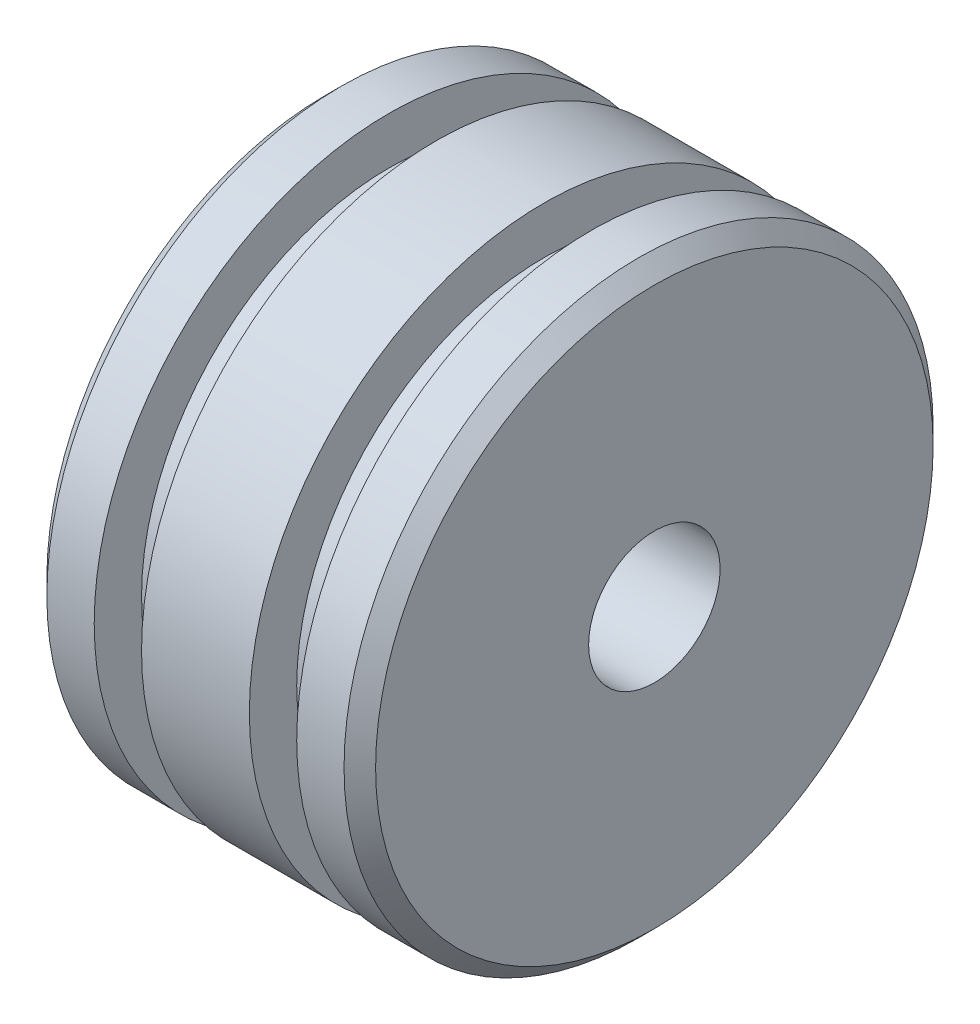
ISO-10303-21;
HEADER;
FILE_DESCRIPTION(('STEP AP214'),'2;1');
FILE_NAME('part.step','',(''),(''),'','','');
FILE_SCHEMA(('AUTOMOTIVE_DESIGN { 1 0 10303 214 1 1 1 1 }'));
ENDSEC;
DATA;
#1=APPLICATION_CONTEXT('core data for automotive mechanical design processes');
#2=APPLICATION_PROTOCOL_DEFINITION('international standard','automotive_design',2000,#1);
#3=PRODUCT_CONTEXT('',#1,'mechanical');
#4=PRODUCT('Part','Part','',(#3));
#5=PRODUCT_RELATED_PRODUCT_CATEGORY('part','',(#4));
#6=PRODUCT_DEFINITION_FORMATION('','',#4);
#7=PRODUCT_DEFINITION_CONTEXT('part definition',#1,'design');
#8=PRODUCT_DEFINITION('design','',#6,#7);
#9=PRODUCT_DEFINITION_SHAPE('','',#8);
#10=(LENGTH_UNIT() NAMED_UNIT(*) SI_UNIT(.MILLI.,.METRE.));
#11=(NAMED_UNIT(*) PLANE_ANGLE_UNIT() SI_UNIT($,.RADIAN.));
#12=(NAMED_UNIT(*) SI_UNIT($,.STERADIAN.) SOLID_ANGLE_UNIT());
#13=UNCERTAINTY_MEASURE_WITH_UNIT(LENGTH_MEASURE(1.E-05),#10,'distance_accuracy_value','');
#14=(GEOMETRIC_REPRESENTATION_CONTEXT(3) GLOBAL_UNCERTAINTY_ASSIGNED_CONTEXT((#13)) GLOBAL_UNIT_ASSIGNED_CONTEXT((#10,
#11,#12)) REPRESENTATION_CONTEXT('',''));
#15=CARTESIAN_POINT('',(0.,0.,0.));
#16=DIRECTION('',(0.,0.,1.));
#17=DIRECTION('',(1.,0.,0.));
#18=AXIS2_PLACEMENT_3D('',#15,#16,#17);
#19=CARTESIAN_POINT('',(15.875,0.,0.));
#20=DIRECTION('',(-1.,0.,0.));
#21=DIRECTION('',(0.,0.,1.));
#22=AXIS2_PLACEMENT_3D('',#19,#20,#21);
#23=CYLINDRICAL_SURFACE('',#22,14.224);
#24=CARTESIAN_POINT('',(5.334,0.,0.));
#25=DIRECTION('',(-1.,0.,0.));
#26=DIRECTION('',(0.,0.,1.));
#27=AXIS2_PLACEMENT_3D('',#24,#25,#26);
#28=CIRCLE('',#27,14.224);
#29=CARTESIAN_POINT('',(5.334,0.,14.224));
#30=VERTEX_POINT('',#29);
#31=EDGE_CURVE('E49',#30,#30,#28,.T.);
#32=ORIENTED_EDGE('',*,*,#31,.F.);
#33=EDGE_LOOP('',(#32));
#34=FACE_BOUND('',#33,.T.);
#35=CARTESIAN_POINT('',(10.541,0.,0.));
#36=DIRECTION('',(-1.,0.,0.));
#37=DIRECTION('',(0.,0.,1.));
#38=AXIS2_PLACEMENT_3D('',#35,#36,#37);
#39=CIRCLE('',#38,14.224);
#40=CARTESIAN_POINT('',(10.541,0.,14.224));
#41=VERTEX_POINT('',#40);
#42=EDGE_CURVE('E58',#41,#41,#39,.T.);
#43=ORIENTED_EDGE('',*,*,#42,.T.);
#44=EDGE_LOOP('',(#43));
#45=FACE_BOUND('',#44,.T.);
#46=ADVANCED_FACE('F26',(#34,#45),#23,.T.);
#47=CARTESIAN_POINT('',(0.762000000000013,0.,0.));
#48=DIRECTION('',(1.,0.,0.));
#49=DIRECTION('',(0.,0.,-1.));
#50=AXIS2_PLACEMENT_3D('',#47,#48,#49);
#51=CIRCLE('',#50,14.224);
#52=CARTESIAN_POINT('',(0.762000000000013,0.,-14.224));
#53=VERTEX_POINT('',#52);
#54=EDGE_CURVE('E33',#53,#53,#51,.T.);
#55=ORIENTED_EDGE('',*,*,#54,.T.);
#56=EDGE_LOOP('',(#55));
#57=FACE_BOUND('',#56,.T.);
#58=CARTESIAN_POINT('',(3.048,0.,0.));
#59=DIRECTION('',(-1.,0.,0.));
#60=DIRECTION('',(0.,0.,1.));
#61=AXIS2_PLACEMENT_3D('',#58,#59,#60);
#62=CIRCLE('',#61,14.224);
#63=CARTESIAN_POINT('',(3.048,0.,14.224));
#64=VERTEX_POINT('',#63);
#65=EDGE_CURVE('E46',#64,#64,#62,.T.);
#66=ORIENTED_EDGE('',*,*,#65,.T.);
#67=EDGE_LOOP('',(#66));
#68=FACE_BOUND('',#67,.T.);
#69=ADVANCED_FACE('F28',(#57,#68),#23,.T.);
#70=CARTESIAN_POINT('',(0.,0.,0.));
#71=DIRECTION('',(1.,0.,0.));
#72=DIRECTION('',(0.,0.,-1.));
#73=AXIS2_PLACEMENT_3D('',#70,#71,#72);
#74=PLANE('',#73);
#75=CARTESIAN_POINT('',(0.,0.,0.));
#76=DIRECTION('',(1.,0.,0.));
#77=DIRECTION('',(0.,0.,-1.));
#78=AXIS2_PLACEMENT_3D('',#75,#76,#77);
#79=CIRCLE('',#78,13.462);
#80=CARTESIAN_POINT('',(0.,0.,-13.462));
#81=VERTEX_POINT('',#80);
#82=EDGE_CURVE('E10',#81,#81,#79,.F.);
#83=ORIENTED_EDGE('',*,*,#82,.T.);
#84=EDGE_LOOP('',(#83));
#85=FACE_BOUND('',#84,.T.);
#86=CARTESIAN_POINT('',(0.,0.,0.));
#87=DIRECTION('',(-1.,0.,0.));
#88=DIRECTION('',(0.,0.,1.));
#89=AXIS2_PLACEMENT_3D('',#86,#87,#88);
#90=CIRCLE('',#89,3.175);
#91=CARTESIAN_POINT('',(0.,0.,3.175));
#92=VERTEX_POINT('',#91);
#93=EDGE_CURVE('E73',#92,#92,#90,.T.);
#94=ORIENTED_EDGE('',*,*,#93,.F.);
#95=EDGE_LOOP('',(#94));
#96=FACE_BOUND('',#95,.T.);
#97=ADVANCED_FACE('F79',(#85,#96),#74,.F.);
#98=CARTESIAN_POINT('',(3.048,14.224,0.));
#99=DIRECTION('',(1.,0.,0.));
#100=DIRECTION('',(0.,0.,-1.));
#101=AXIS2_PLACEMENT_3D('',#98,#99,#100);
#102=PLANE('',#101);
#103=CARTESIAN_POINT('',(3.048,0.,0.));
#104=DIRECTION('',(-1.,0.,0.));
#105=DIRECTION('',(0.,0.,1.));
#106=AXIS2_PLACEMENT_3D('',#103,#104,#105);
#107=CIRCLE('',#106,11.938);
#108=CARTESIAN_POINT('',(3.048,0.,11.938));
#109=VERTEX_POINT('',#108);
#110=EDGE_CURVE('E55',#109,#109,#107,.T.);
#111=ORIENTED_EDGE('',*,*,#110,.T.);
#112=EDGE_LOOP('',(#111));
#113=FACE_BOUND('',#112,.T.);
#114=ORIENTED_EDGE('',*,*,#65,.F.);
#115=EDGE_LOOP('',(#114));
#116=FACE_BOUND('',#115,.T.);
#117=ADVANCED_FACE('F81',(#113,#116),#102,.T.);
#118=CARTESIAN_POINT('',(5.334,11.938,0.));
#119=DIRECTION('',(-1.,0.,0.));
#120=DIRECTION('',(0.,0.,1.));
#121=AXIS2_PLACEMENT_3D('',#118,#119,#120);
#122=PLANE('',#121);
#123=ORIENTED_EDGE('',*,*,#31,.T.);
#124=EDGE_LOOP('',(#123));
#125=FACE_BOUND('',#124,.T.);
#126=CARTESIAN_POINT('',(5.334,0.,0.));
#127=DIRECTION('',(-1.,0.,0.));
#128=DIRECTION('',(0.,0.,1.));
#129=AXIS2_PLACEMENT_3D('',#126,#127,#128);
#130=CIRCLE('',#129,11.938);
#131=CARTESIAN_POINT('',(5.334,0.,11.938));
#132=VERTEX_POINT('',#131);
#133=EDGE_CURVE('E52',#132,#132,#130,.T.);
#134=ORIENTED_EDGE('',*,*,#133,.F.);
#135=EDGE_LOOP('',(#134));
#136=FACE_BOUND('',#135,.T.);
#137=ADVANCED_FACE('F88',(#125,#136),#122,.T.);
#138=CARTESIAN_POINT('',(0.,0.,0.));
#139=DIRECTION('',(-1.,0.,0.));
#140=DIRECTION('',(0.,0.,1.));
#141=AXIS2_PLACEMENT_3D('',#138,#139,#140);
#142=CYLINDRICAL_SURFACE('',#141,11.938);
#143=ORIENTED_EDGE('',*,*,#110,.F.);
#144=EDGE_LOOP('',(#143));
#145=FACE_BOUND('',#144,.T.);
#146=ORIENTED_EDGE('',*,*,#133,.T.);
#147=EDGE_LOOP('',(#146));
#148=FACE_BOUND('',#147,.T.);
#149=ADVANCED_FACE('F131',(#145,#148),#142,.T.);
#150=CARTESIAN_POINT('',(10.541,14.224,0.));
#151=DIRECTION('',(1.,0.,0.));
#152=DIRECTION('',(0.,0.,-1.));
#153=AXIS2_PLACEMENT_3D('',#150,#151,#152);
#154=PLANE('',#153);
#155=CARTESIAN_POINT('',(10.541,0.,0.));
#156=DIRECTION('',(-1.,0.,0.));
#157=DIRECTION('',(0.,0.,1.));
#158=AXIS2_PLACEMENT_3D('',#155,#156,#157);
#159=CIRCLE('',#158,11.938);
#160=CARTESIAN_POINT('',(10.541,0.,11.938));
#161=VERTEX_POINT('',#160);
#162=EDGE_CURVE('E67',#161,#161,#159,.T.);
#163=ORIENTED_EDGE('',*,*,#162,.T.);
#164=EDGE_LOOP('',(#163));
#165=FACE_BOUND('',#164,.T.);
#166=ORIENTED_EDGE('',*,*,#42,.F.);
#167=EDGE_LOOP('',(#166));
#168=FACE_BOUND('',#167,.T.);
#169=ADVANCED_FACE('F117',(#165,#168),#154,.T.);
#170=CARTESIAN_POINT('',(12.827,11.938,0.));
#171=DIRECTION('',(-1.,0.,0.));
#172=DIRECTION('',(0.,0.,1.));
#173=AXIS2_PLACEMENT_3D('',#170,#171,#172);
#174=PLANE('',#173);
#175=CARTESIAN_POINT('',(12.827,0.,0.));
#176=DIRECTION('',(-1.,0.,0.));
#177=DIRECTION('',(0.,0.,1.));
#178=AXIS2_PLACEMENT_3D('',#175,#176,#177);
#179=CIRCLE('',#178,14.224);
#180=CARTESIAN_POINT('',(12.827,0.,14.224));
#181=VERTEX_POINT('',#180);
#182=EDGE_CURVE('E61',#181,#181,#179,.T.);
#183=ORIENTED_EDGE('',*,*,#182,.T.);
#184=EDGE_LOOP('',(#183));
#185=FACE_BOUND('',#184,.T.);
#186=CARTESIAN_POINT('',(12.827,0.,0.));
#187=DIRECTION('',(-1.,0.,0.));
#188=DIRECTION('',(0.,0.,1.));
#189=AXIS2_PLACEMENT_3D('',#186,#187,#188);
#190=CIRCLE('',#189,11.938);
#191=CARTESIAN_POINT('',(12.827,0.,11.938));
#192=VERTEX_POINT('',#191);
#193=EDGE_CURVE('E64',#192,#192,#190,.T.);
#194=ORIENTED_EDGE('',*,*,#193,.F.);
#195=EDGE_LOOP('',(#194));
#196=FACE_BOUND('',#195,.T.);
#197=ADVANCED_FACE('F114',(#185,#196),#174,.T.);
#198=CARTESIAN_POINT('',(0.,0.,0.));
#199=DIRECTION('',(-1.,0.,0.));
#200=DIRECTION('',(0.,0.,1.));
#201=AXIS2_PLACEMENT_3D('',#198,#199,#200);
#202=CYLINDRICAL_SURFACE('',#201,11.938);
#203=ORIENTED_EDGE('',*,*,#162,.F.);
#204=EDGE_LOOP('',(#203));
#205=FACE_BOUND('',#204,.T.);
#206=ORIENTED_EDGE('',*,*,#193,.T.);
#207=EDGE_LOOP('',(#206));
#208=FACE_BOUND('',#207,.T.);
#209=ADVANCED_FACE('F108',(#205,#208),#202,.T.);
#210=CARTESIAN_POINT('',(15.875,0.,0.));
#211=DIRECTION('',(1.,0.,0.));
#212=DIRECTION('',(0.,0.,-1.));
#213=AXIS2_PLACEMENT_3D('',#210,#211,#212);
#214=PLANE('',#213);
#215=CARTESIAN_POINT('',(15.875,0.,0.));
#216=DIRECTION('',(1.,0.,0.));
#217=DIRECTION('',(0.,0.,-1.));
#218=AXIS2_PLACEMENT_3D('',#215,#216,#217);
#219=CIRCLE('',#218,13.462);
#220=CARTESIAN_POINT('',(15.875,0.,-13.462));
#221=VERTEX_POINT('',#220);
#222=EDGE_CURVE('E41',#221,#221,#219,.T.);
#223=ORIENTED_EDGE('',*,*,#222,.T.);
#224=EDGE_LOOP('',(#223));
#225=FACE_BOUND('',#224,.T.);
#226=CARTESIAN_POINT('',(15.875,0.,0.));
#227=DIRECTION('',(-1.,0.,0.));
#228=DIRECTION('',(0.,0.,1.));
#229=AXIS2_PLACEMENT_3D('',#226,#227,#228);
#230=CIRCLE('',#229,3.175);
#231=CARTESIAN_POINT('',(15.875,0.,3.175));
#232=VERTEX_POINT('',#231);
#233=EDGE_CURVE('E70',#232,#232,#230,.T.);
#234=ORIENTED_EDGE('',*,*,#233,.T.);
#235=EDGE_LOOP('',(#234));
#236=FACE_BOUND('',#235,.T.);
#237=ADVANCED_FACE('F99',(#225,#236),#214,.T.);
#238=CARTESIAN_POINT('',(15.113,0.,0.));
#239=DIRECTION('',(1.,0.,0.));
#240=DIRECTION('',(0.,0.,-1.));
#241=AXIS2_PLACEMENT_3D('',#238,#239,#240);
#242=CIRCLE('',#241,14.224);
#243=CARTESIAN_POINT('',(15.113,0.,-14.224));
#244=VERTEX_POINT('',#243);
#245=EDGE_CURVE('E37',#244,#244,#242,.F.);
#246=ORIENTED_EDGE('',*,*,#245,.T.);
#247=EDGE_LOOP('',(#246));
#248=FACE_BOUND('',#247,.T.);
#249=ORIENTED_EDGE('',*,*,#182,.F.);
#250=EDGE_LOOP('',(#249));
#251=FACE_BOUND('',#250,.T.);
#252=ADVANCED_FACE('F91',(#248,#251),#23,.T.);
#253=CARTESIAN_POINT('',(15.875,0.,0.));
#254=DIRECTION('',(-1.,0.,0.));
#255=DIRECTION('',(0.,0.,1.));
#256=AXIS2_PLACEMENT_3D('',#253,#254,#255);
#257=CYLINDRICAL_SURFACE('',#256,3.175);
#258=ORIENTED_EDGE('',*,*,#233,.F.);
#259=EDGE_LOOP('',(#258));
#260=FACE_BOUND('',#259,.T.);
#261=ORIENTED_EDGE('',*,*,#93,.T.);
#262=EDGE_LOOP('',(#261));
#263=FACE_BOUND('',#262,.T.);
#264=ADVANCED_FACE('F77',(#260,#263),#257,.F.);
#265=CARTESIAN_POINT('',(15.875,0.,0.));
#266=DIRECTION('',(-1.,0.,0.));
#267=DIRECTION('',(0.,0.,1.));
#268=AXIS2_PLACEMENT_3D('',#265,#266,#267);
#269=CONICAL_SURFACE('',#268,13.462,0.785398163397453);
#270=ORIENTED_EDGE('',*,*,#245,.F.);
#271=EDGE_LOOP('',(#270));
#272=FACE_BOUND('',#271,.T.);
#273=ORIENTED_EDGE('',*,*,#222,.F.);
#274=EDGE_LOOP('',(#273));
#275=FACE_BOUND('',#274,.T.);
#276=ADVANCED_FACE('F105',(#272,#275),#269,.T.);
#277=CARTESIAN_POINT('',(0.762000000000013,0.,0.));
#278=DIRECTION('',(1.,0.,0.));
#279=DIRECTION('',(0.,0.,-1.));
#280=AXIS2_PLACEMENT_3D('',#277,#278,#279);
#281=CONICAL_SURFACE('',#280,14.224,0.785398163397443);
#282=CARTESIAN_POINT('',(0.,0.,-13.462));
#283=CARTESIAN_POINT('',(0.00793750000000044,0.,-13.4699375));
#284=CARTESIAN_POINT('',(0.0158750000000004,0.,-13.477875));
#285=CARTESIAN_POINT('',(0.0317500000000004,0.,-13.49375));
#286=CARTESIAN_POINT('',(0.0396875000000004,0.,-13.5016875));
#287=CARTESIAN_POINT('',(0.0555625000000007,0.,-13.5175625));
#288=CARTESIAN_POINT('',(0.0635000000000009,0.,-13.5255));
#289=CARTESIAN_POINT('',(0.0793750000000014,0.,-13.541375));
#290=CARTESIAN_POINT('',(0.0873125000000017,0.,-13.5493125));
#291=CARTESIAN_POINT('',(0.103187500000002,0.,-13.5651875));
#292=CARTESIAN_POINT('',(0.111125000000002,0.,-13.573125));
#293=CARTESIAN_POINT('',(0.127000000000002,0.,-13.589));
#294=CARTESIAN_POINT('',(0.134937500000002,0.,-13.5969375));
#295=CARTESIAN_POINT('',(0.150812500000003,0.,-13.6128125));
#296=CARTESIAN_POINT('',(0.158750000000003,0.,-13.62075));
#297=CARTESIAN_POINT('',(0.174625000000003,0.,-13.636625));
#298=CARTESIAN_POINT('',(0.182562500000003,0.,-13.6445625));
#299=CARTESIAN_POINT('',(0.198437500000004,0.,-13.6604375));
#300=CARTESIAN_POINT('',(0.206375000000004,0.,-13.668375));
#301=CARTESIAN_POINT('',(0.222250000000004,0.,-13.68425));
#302=CARTESIAN_POINT('',(0.230187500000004,0.,-13.6921875));
#303=CARTESIAN_POINT('',(0.246062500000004,0.,-13.7080625));
#304=CARTESIAN_POINT('',(0.254000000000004,0.,-13.716));
#305=CARTESIAN_POINT('',(0.269875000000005,0.,-13.731875));
#306=CARTESIAN_POINT('',(0.277812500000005,0.,-13.7398125));
#307=CARTESIAN_POINT('',(0.293687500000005,0.,-13.7556875));
#308=CARTESIAN_POINT('',(0.301625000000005,0.,-13.763625));
#309=CARTESIAN_POINT('',(0.317500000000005,0.,-13.7795));
#310=CARTESIAN_POINT('',(0.325437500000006,0.,-13.7874375));
#311=CARTESIAN_POINT('',(0.341312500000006,0.,-13.8033125));
#312=CARTESIAN_POINT('',(0.349250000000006,0.,-13.81125));
#313=CARTESIAN_POINT('',(0.365125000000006,0.,-13.827125));
#314=CARTESIAN_POINT('',(0.373062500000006,0.,-13.8350625));
#315=CARTESIAN_POINT('',(0.388937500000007,0.,-13.8509375));
#316=CARTESIAN_POINT('',(0.396875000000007,0.,-13.858875));
#317=CARTESIAN_POINT('',(0.412750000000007,0.,-13.87475));
#318=CARTESIAN_POINT('',(0.420687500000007,0.,-13.8826875));
#319=CARTESIAN_POINT('',(0.436562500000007,0.,-13.8985625));
#320=CARTESIAN_POINT('',(0.444500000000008,0.,-13.9065));
#321=CARTESIAN_POINT('',(0.460375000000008,0.,-13.922375));
#322=CARTESIAN_POINT('',(0.468312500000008,0.,-13.9303125));
#323=CARTESIAN_POINT('',(0.484187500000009,0.,-13.9461875));
#324=CARTESIAN_POINT('',(0.492125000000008,0.,-13.954125));
#325=CARTESIAN_POINT('',(0.508000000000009,0.,-13.97));
#326=CARTESIAN_POINT('',(0.515937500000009,0.,-13.9779375));
#327=CARTESIAN_POINT('',(0.531812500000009,0.,-13.9938125));
#328=CARTESIAN_POINT('',(0.539750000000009,0.,-14.00175));
#329=CARTESIAN_POINT('',(0.555625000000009,0.,-14.017625));
#330=CARTESIAN_POINT('',(0.56356250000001,0.,-14.0255625));
#331=CARTESIAN_POINT('',(0.57943750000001,0.,-14.0414375));
#332=CARTESIAN_POINT('',(0.58737500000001,0.,-14.049375));
#333=CARTESIAN_POINT('',(0.603250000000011,0.,-14.06525));
#334=CARTESIAN_POINT('',(0.61118750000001,0.,-14.0731875));
#335=CARTESIAN_POINT('',(0.627062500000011,0.,-14.0890625));
#336=CARTESIAN_POINT('',(0.635000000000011,0.,-14.097));
#337=CARTESIAN_POINT('',(0.650875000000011,0.,-14.112875));
#338=CARTESIAN_POINT('',(0.658812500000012,0.,-14.1208125));
#339=CARTESIAN_POINT('',(0.674687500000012,0.,-14.1366875));
#340=CARTESIAN_POINT('',(0.682625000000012,0.,-14.144625));
#341=CARTESIAN_POINT('',(0.698500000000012,0.,-14.1605));
#342=CARTESIAN_POINT('',(0.706437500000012,0.,-14.1684375));
#343=CARTESIAN_POINT('',(0.722312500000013,0.,-14.1843125));
#344=CARTESIAN_POINT('',(0.730250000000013,0.,-14.19225));
#345=CARTESIAN_POINT('',(0.746125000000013,0.,-14.208125));
#346=CARTESIAN_POINT('',(0.754062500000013,0.,-14.2160625));
#347=CARTESIAN_POINT('',(0.762000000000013,0.,-14.224));
#348=B_SPLINE_CURVE_WITH_KNOTS('',3,(#282,#283,#284,#285,#286,#287,#288,#289,#290,#291,#292,
#293,#294,#295,#296,#297,#298,#299,#300,#301,#302,#303,#304,#305,#306,#307,#308,#309,#310,#311,
#312,#313,#314,#315,#316,#317,#318,#319,#320,#321,#322,#323,#324,#325,#326,#327,#328,#329,#330,
#331,#332,#333,#334,#335,#336,#337,#338,#339,#340,#341,#342,#343,#344,#345,#346,#347),
.UNSPECIFIED.,.F.,.F.,(4,2,2,2,2,2,2,2,2,2,2,2,2,2,2,2,2,2,2,2,2,2,2,2,2,2,2,2,2,2,2,2,4),(0.,
0.0336759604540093,0.0673519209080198,0.101027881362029,0.134703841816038,0.168379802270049,
0.202055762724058,0.235731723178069,0.269407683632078,0.303083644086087,0.336759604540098,
0.370435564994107,0.404111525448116,0.437787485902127,0.471463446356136,0.505139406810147,
0.538815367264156,0.572491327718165,0.606167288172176,0.639843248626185,0.673519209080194,
0.707195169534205,0.740871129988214,0.774547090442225,0.808223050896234,0.841899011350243,
0.875574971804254,0.909250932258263,0.942926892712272,0.976602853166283,1.01027881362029,
1.0439547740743,1.07763073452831),.UNSPECIFIED.);
#349=EDGE_CURVE('BSEAM169',#81,#53,#348,.T.);
#350=ORIENTED_EDGE('',*,*,#82,.F.);
#351=ORIENTED_EDGE('',*,*,#54,.F.);
#352=ORIENTED_EDGE('',*,*,#349,.T.);
#353=ORIENTED_EDGE('',*,*,#349,.F.);
#354=EDGE_LOOP('',(#350,#352,#351,#353));
#355=FACE_BOUND('',#354,.T.);
#356=ADVANCED_FACE('F169',(#355),#281,.T.);
#357=CLOSED_SHELL('',(#46,#69,#97,#117,#137,#149,#169,#197,#209,#237,#252,#264,#276,#356));
#358=MANIFOLD_SOLID_BREP('B2',#357);
#359=ADVANCED_BREP_SHAPE_REPRESENTATION('',(#18,#358),#14);
#360=SHAPE_DEFINITION_REPRESENTATION(#9,#359);
ENDSEC;
END-ISO-10303-21;
